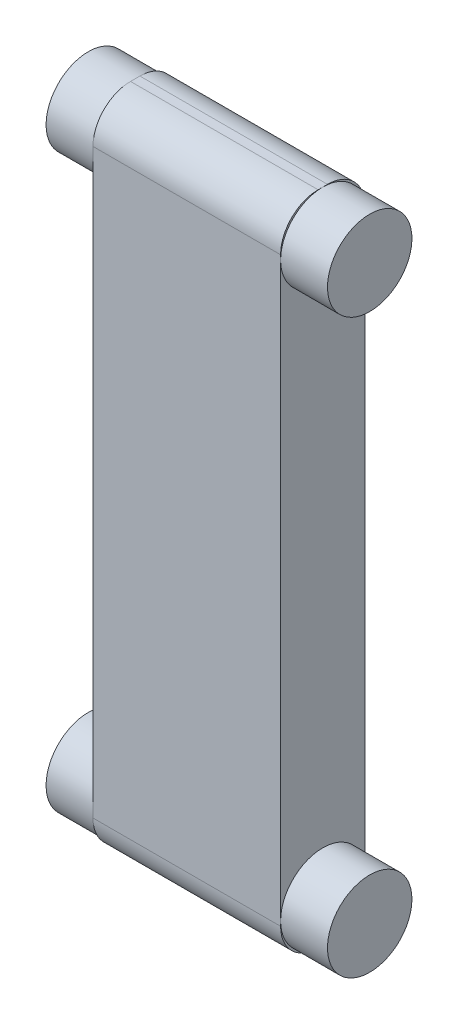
ISO-10303-21;
HEADER;
FILE_DESCRIPTION(('STEP AP214'),'2;1');
FILE_NAME('part.step','',(''),(''),'','','');
FILE_SCHEMA(('AUTOMOTIVE_DESIGN { 1 0 10303 214 1 1 1 1 }'));
ENDSEC;
DATA;
#1=APPLICATION_CONTEXT('core data for automotive mechanical design processes');
#2=APPLICATION_PROTOCOL_DEFINITION('international standard','automotive_design',2000,#1);
#3=PRODUCT_CONTEXT('',#1,'mechanical');
#4=PRODUCT('Part','Part','',(#3));
#5=PRODUCT_RELATED_PRODUCT_CATEGORY('part','',(#4));
#6=PRODUCT_DEFINITION_FORMATION('','',#4);
#7=PRODUCT_DEFINITION_CONTEXT('part definition',#1,'design');
#8=PRODUCT_DEFINITION('design','',#6,#7);
#9=PRODUCT_DEFINITION_SHAPE('','',#8);
#10=(LENGTH_UNIT() NAMED_UNIT(*) SI_UNIT(.MILLI.,.METRE.));
#11=(NAMED_UNIT(*) PLANE_ANGLE_UNIT() SI_UNIT($,.RADIAN.));
#12=(NAMED_UNIT(*) SI_UNIT($,.STERADIAN.) SOLID_ANGLE_UNIT());
#13=UNCERTAINTY_MEASURE_WITH_UNIT(LENGTH_MEASURE(1.E-05),#10,'distance_accuracy_value','');
#14=(GEOMETRIC_REPRESENTATION_CONTEXT(3) GLOBAL_UNCERTAINTY_ASSIGNED_CONTEXT((#13)) GLOBAL_UNIT_ASSIGNED_CONTEXT((#10,
#11,#12)) REPRESENTATION_CONTEXT('',''));
#15=CARTESIAN_POINT('',(0.,0.,0.));
#16=DIRECTION('',(0.,0.,1.));
#17=DIRECTION('',(1.,0.,0.));
#18=AXIS2_PLACEMENT_3D('',#15,#16,#17);
#19=CARTESIAN_POINT('',(50.,305.,45.));
#20=DIRECTION('',(-1.,0.,0.));
#21=DIRECTION('',(0.,-1.,0.));
#22=AXIS2_PLACEMENT_3D('',#19,#20,#21);
#23=PLANE('',#22);
#24=CARTESIAN_POINT('',(50.,327.5,22.5));
#25=DIRECTION('',(-1.,0.,0.));
#26=DIRECTION('',(0.,-1.,0.));
#27=AXIS2_PLACEMENT_3D('',#24,#25,#26);
#28=CIRCLE('',#27,22.5);
#29=CARTESIAN_POINT('',(50.,327.5,45.));
#30=VERTEX_POINT('',#29);
#31=CARTESIAN_POINT('',(50.,327.5,0.));
#32=VERTEX_POINT('',#31);
#33=EDGE_CURVE('E301',#30,#32,#28,.F.);
#34=ORIENTED_EDGE('',*,*,#33,.F.);
#35=DIRECTION('',(0.,1.,0.));
#36=VECTOR('',#35,1.);
#37=CARTESIAN_POINT('',(50.,305.,45.));
#38=LINE('',#37,#36);
#39=CARTESIAN_POINT('',(50.,22.5000000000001,45.));
#40=VERTEX_POINT('',#39);
#41=EDGE_CURVE('E191',#40,#30,#38,.T.);
#42=ORIENTED_EDGE('',*,*,#41,.F.);
#43=CARTESIAN_POINT('',(50.,22.5000000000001,22.5));
#44=DIRECTION('',(-1.,0.,0.));
#45=DIRECTION('',(0.,-1.,0.));
#46=AXIS2_PLACEMENT_3D('',#43,#44,#45);
#47=CIRCLE('',#46,22.5);
#48=CARTESIAN_POINT('',(50.,22.5000000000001,0.));
#49=VERTEX_POINT('',#48);
#50=EDGE_CURVE('E272',#49,#40,#47,.F.);
#51=ORIENTED_EDGE('',*,*,#50,.F.);
#52=DIRECTION('',(0.,1.,0.));
#53=VECTOR('',#52,1.);
#54=CARTESIAN_POINT('',(50.,305.,0.));
#55=LINE('',#54,#53);
#56=EDGE_CURVE('E192',#49,#32,#55,.T.);
#57=ORIENTED_EDGE('',*,*,#56,.T.);
#58=EDGE_LOOP('',(#34,#42,#51,#57));
#59=FACE_BOUND('',#58,.T.);
#60=ADVANCED_FACE('F65',(#59),#23,.F.);
#61=CARTESIAN_POINT('',(-74.9999999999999,350.,45.));
#62=DIRECTION('',(0.,-1.,0.));
#63=DIRECTION('',(0.,0.,-1.));
#64=AXIS2_PLACEMENT_3D('',#61,#62,#63);
#65=PLANE('',#64);
#66=DIRECTION('',(0.,0.,-1.));
#67=VECTOR('',#66,1.);
#68=CARTESIAN_POINT('',(50.,350.,45.));
#69=LINE('',#68,#67);
#70=CARTESIAN_POINT('',(50.,350.,22.5));
#71=VERTEX_POINT('',#70);
#72=CARTESIAN_POINT('',(50.,350.,20.));
#73=VERTEX_POINT('',#72);
#74=EDGE_CURVE('E305',#71,#73,#69,.T.);
#75=ORIENTED_EDGE('',*,*,#74,.T.);
#76=DIRECTION('',(-1.,0.,0.));
#77=VECTOR('',#76,1.);
#78=CARTESIAN_POINT('',(-74.9999999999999,350.,20.));
#79=LINE('',#78,#77);
#80=CARTESIAN_POINT('',(-50.0000000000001,350.,20.));
#81=VERTEX_POINT('',#80);
#82=EDGE_CURVE('E333',#73,#81,#79,.T.);
#83=ORIENTED_EDGE('',*,*,#82,.T.);
#84=DIRECTION('',(0.,0.,1.));
#85=VECTOR('',#84,1.);
#86=CARTESIAN_POINT('',(-50.0000000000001,350.,45.));
#87=LINE('',#86,#85);
#88=CARTESIAN_POINT('',(-50.0000000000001,350.,22.5));
#89=VERTEX_POINT('',#88);
#90=EDGE_CURVE('E288',#81,#89,#87,.T.);
#91=ORIENTED_EDGE('',*,*,#90,.T.);
#92=CARTESIAN_POINT('',(-50.0000000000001,350.,25.));
#93=VERTEX_POINT('',#92);
#94=EDGE_CURVE('E291',#89,#93,#87,.T.);
#95=ORIENTED_EDGE('',*,*,#94,.T.);
#96=DIRECTION('',(-1.,0.,0.));
#97=VECTOR('',#96,1.);
#98=CARTESIAN_POINT('',(50.,350.,25.));
#99=LINE('',#98,#97);
#100=CARTESIAN_POINT('',(50.,350.,25.));
#101=VERTEX_POINT('',#100);
#102=EDGE_CURVE('E179',#93,#101,#99,.F.);
#103=ORIENTED_EDGE('',*,*,#102,.T.);
#104=EDGE_CURVE('E310',#101,#71,#69,.T.);
#105=ORIENTED_EDGE('',*,*,#104,.T.);
#106=EDGE_LOOP('',(#75,#83,#91,#95,#103,#105));
#107=FACE_BOUND('',#106,.T.);
#108=ADVANCED_FACE('F234',(#107),#65,.F.);
#109=CARTESIAN_POINT('',(-50.,45.,45.));
#110=DIRECTION('',(1.,0.,0.));
#111=DIRECTION('',(0.,1.,0.));
#112=AXIS2_PLACEMENT_3D('',#109,#110,#111);
#113=PLANE('',#112);
#114=DIRECTION('',(0.,-1.,0.));
#115=VECTOR('',#114,1.);
#116=CARTESIAN_POINT('',(-50.,45.,0.));
#117=LINE('',#116,#115);
#118=CARTESIAN_POINT('',(-50.0000000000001,327.5,0.));
#119=VERTEX_POINT('',#118);
#120=CARTESIAN_POINT('',(-50.,22.5,0.));
#121=VERTEX_POINT('',#120);
#122=EDGE_CURVE('E171',#119,#121,#117,.T.);
#123=ORIENTED_EDGE('',*,*,#122,.T.);
#124=CARTESIAN_POINT('',(-50.,22.5,22.5));
#125=DIRECTION('',(1.,0.,0.));
#126=DIRECTION('',(0.,1.,0.));
#127=AXIS2_PLACEMENT_3D('',#124,#125,#126);
#128=CIRCLE('',#127,22.5);
#129=CARTESIAN_POINT('',(-50.,22.5,45.));
#130=VERTEX_POINT('',#129);
#131=EDGE_CURVE('E186',#130,#121,#128,.F.);
#132=ORIENTED_EDGE('',*,*,#131,.F.);
#133=DIRECTION('',(0.,-1.,0.));
#134=VECTOR('',#133,1.);
#135=CARTESIAN_POINT('',(-50.,45.,45.));
#136=LINE('',#135,#134);
#137=CARTESIAN_POINT('',(-50.0000000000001,327.5,45.));
#138=VERTEX_POINT('',#137);
#139=EDGE_CURVE('E317',#138,#130,#136,.T.);
#140=ORIENTED_EDGE('',*,*,#139,.F.);
#141=CARTESIAN_POINT('',(-50.0000000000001,327.5,22.5));
#142=DIRECTION('',(1.,0.,0.));
#143=DIRECTION('',(0.,1.,0.));
#144=AXIS2_PLACEMENT_3D('',#141,#142,#143);
#145=CIRCLE('',#144,22.5);
#146=EDGE_CURVE('E189',#119,#138,#145,.F.);
#147=ORIENTED_EDGE('',*,*,#146,.F.);
#148=EDGE_LOOP('',(#123,#132,#140,#147));
#149=FACE_BOUND('',#148,.T.);
#150=ADVANCED_FACE('F184',(#149),#113,.F.);
#151=CARTESIAN_POINT('',(-75.,0.,45.));
#152=DIRECTION('',(0.,1.,0.));
#153=DIRECTION('',(-1.,0.,0.));
#154=AXIS2_PLACEMENT_3D('',#151,#152,#153);
#155=PLANE('',#154);
#156=DIRECTION('',(0.,0.,-1.));
#157=VECTOR('',#156,1.);
#158=CARTESIAN_POINT('',(-50.,0.,45.));
#159=LINE('',#158,#157);
#160=CARTESIAN_POINT('',(-50.,0.,22.5));
#161=VERTEX_POINT('',#160);
#162=CARTESIAN_POINT('',(-50.,0.,20.));
#163=VERTEX_POINT('',#162);
#164=EDGE_CURVE('E199',#161,#163,#159,.T.);
#165=ORIENTED_EDGE('',*,*,#164,.T.);
#166=DIRECTION('',(1.,0.,0.));
#167=VECTOR('',#166,1.);
#168=CARTESIAN_POINT('',(-75.,0.,20.));
#169=LINE('',#168,#167);
#170=CARTESIAN_POINT('',(50.,0.,20.));
#171=VERTEX_POINT('',#170);
#172=EDGE_CURVE('E365',#163,#171,#169,.T.);
#173=ORIENTED_EDGE('',*,*,#172,.T.);
#174=DIRECTION('',(0.,0.,1.));
#175=VECTOR('',#174,1.);
#176=CARTESIAN_POINT('',(50.,0.,45.));
#177=LINE('',#176,#175);
#178=CARTESIAN_POINT('',(50.,0.,22.5));
#179=VERTEX_POINT('',#178);
#180=EDGE_CURVE('E261',#171,#179,#177,.T.);
#181=ORIENTED_EDGE('',*,*,#180,.T.);
#182=CARTESIAN_POINT('',(50.,0.,25.));
#183=VERTEX_POINT('',#182);
#184=EDGE_CURVE('E267',#179,#183,#177,.T.);
#185=ORIENTED_EDGE('',*,*,#184,.T.);
#186=DIRECTION('',(1.,0.,0.));
#187=VECTOR('',#186,1.);
#188=CARTESIAN_POINT('',(-50.,0.,25.));
#189=LINE('',#188,#187);
#190=CARTESIAN_POINT('',(-50.,0.,25.));
#191=VERTEX_POINT('',#190);
#192=EDGE_CURVE('E362',#183,#191,#189,.F.);
#193=ORIENTED_EDGE('',*,*,#192,.T.);
#194=EDGE_CURVE('E209',#191,#161,#159,.T.);
#195=ORIENTED_EDGE('',*,*,#194,.T.);
#196=EDGE_LOOP('',(#165,#173,#181,#185,#193,#195));
#197=FACE_BOUND('',#196,.T.);
#198=ADVANCED_FACE('F422',(#197),#155,.F.);
#199=CARTESIAN_POINT('',(0.,0.,45.));
#200=DIRECTION('',(0.,0.,1.));
#201=DIRECTION('',(1.,0.,0.));
#202=AXIS2_PLACEMENT_3D('',#199,#200,#201);
#203=PLANE('',#202);
#204=DIRECTION('',(0.,-1.,0.));
#205=VECTOR('',#204,1.);
#206=CARTESIAN_POINT('',(50.,0.,45.));
#207=LINE('',#206,#205);
#208=CARTESIAN_POINT('',(50.,330.,45.));
#209=VERTEX_POINT('',#208);
#210=EDGE_CURVE('E311',#209,#30,#207,.T.);
#211=ORIENTED_EDGE('',*,*,#210,.F.);
#212=DIRECTION('',(-1.,0.,0.));
#213=VECTOR('',#212,1.);
#214=CARTESIAN_POINT('',(-50.0000000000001,330.,45.));
#215=LINE('',#214,#213);
#216=CARTESIAN_POINT('',(-50.0000000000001,330.,45.));
#217=VERTEX_POINT('',#216);
#218=EDGE_CURVE('E352',#209,#217,#215,.T.);
#219=ORIENTED_EDGE('',*,*,#218,.T.);
#220=DIRECTION('',(0.,1.,0.));
#221=VECTOR('',#220,1.);
#222=CARTESIAN_POINT('',(-50.,0.,45.));
#223=LINE('',#222,#221);
#224=EDGE_CURVE('E292',#138,#217,#223,.T.);
#225=ORIENTED_EDGE('',*,*,#224,.F.);
#226=ORIENTED_EDGE('',*,*,#139,.T.);
#227=DIRECTION('',(0.,1.,0.));
#228=VECTOR('',#227,1.);
#229=CARTESIAN_POINT('',(-50.,0.,45.));
#230=LINE('',#229,#228);
#231=CARTESIAN_POINT('',(-50.,20.,45.));
#232=VERTEX_POINT('',#231);
#233=EDGE_CURVE('E445',#232,#130,#230,.T.);
#234=ORIENTED_EDGE('',*,*,#233,.F.);
#235=DIRECTION('',(1.,0.,0.));
#236=VECTOR('',#235,1.);
#237=CARTESIAN_POINT('',(50.,20.,45.));
#238=LINE('',#237,#236);
#239=CARTESIAN_POINT('',(50.,20.,45.));
#240=VERTEX_POINT('',#239);
#241=EDGE_CURVE('E348',#232,#240,#238,.T.);
#242=ORIENTED_EDGE('',*,*,#241,.T.);
#243=DIRECTION('',(0.,-1.,0.));
#244=VECTOR('',#243,1.);
#245=CARTESIAN_POINT('',(50.,0.,45.));
#246=LINE('',#245,#244);
#247=EDGE_CURVE('E271',#40,#240,#246,.T.);
#248=ORIENTED_EDGE('',*,*,#247,.F.);
#249=ORIENTED_EDGE('',*,*,#41,.T.);
#250=EDGE_LOOP('',(#211,#219,#225,#226,#234,#242,#248,#249));
#251=FACE_BOUND('',#250,.T.);
#252=ADVANCED_FACE('F411',(#251),#203,.T.);
#253=CARTESIAN_POINT('',(0.,0.,0.));
#254=DIRECTION('',(0.,0.,1.));
#255=DIRECTION('',(1.,0.,0.));
#256=AXIS2_PLACEMENT_3D('',#253,#254,#255);
#257=PLANE('',#256);
#258=DIRECTION('',(0.,1.,0.));
#259=VECTOR('',#258,1.);
#260=CARTESIAN_POINT('',(-50.,0.,0.));
#261=LINE('',#260,#259);
#262=CARTESIAN_POINT('',(-50.0000000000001,330.,0.));
#263=VERTEX_POINT('',#262);
#264=EDGE_CURVE('E326',#119,#263,#261,.T.);
#265=ORIENTED_EDGE('',*,*,#264,.T.);
#266=DIRECTION('',(-1.,0.,0.));
#267=VECTOR('',#266,1.);
#268=CARTESIAN_POINT('',(0.,330.,0.));
#269=LINE('',#268,#267);
#270=CARTESIAN_POINT('',(50.,330.,0.));
#271=VERTEX_POINT('',#270);
#272=EDGE_CURVE('E342',#263,#271,#269,.F.);
#273=ORIENTED_EDGE('',*,*,#272,.T.);
#274=DIRECTION('',(0.,-1.,0.));
#275=VECTOR('',#274,1.);
#276=CARTESIAN_POINT('',(50.,0.,0.));
#277=LINE('',#276,#275);
#278=EDGE_CURVE('E320',#271,#32,#277,.T.);
#279=ORIENTED_EDGE('',*,*,#278,.T.);
#280=ORIENTED_EDGE('',*,*,#56,.F.);
#281=DIRECTION('',(0.,-1.,0.));
#282=VECTOR('',#281,1.);
#283=CARTESIAN_POINT('',(50.,0.,0.));
#284=LINE('',#283,#282);
#285=CARTESIAN_POINT('',(50.,20.,0.));
#286=VERTEX_POINT('',#285);
#287=EDGE_CURVE('E180',#49,#286,#284,.T.);
#288=ORIENTED_EDGE('',*,*,#287,.T.);
#289=DIRECTION('',(1.,0.,0.));
#290=VECTOR('',#289,1.);
#291=CARTESIAN_POINT('',(0.,20.,0.));
#292=LINE('',#291,#290);
#293=CARTESIAN_POINT('',(-50.,20.,0.));
#294=VERTEX_POINT('',#293);
#295=EDGE_CURVE('E174',#286,#294,#292,.F.);
#296=ORIENTED_EDGE('',*,*,#295,.T.);
#297=DIRECTION('',(0.,1.,0.));
#298=VECTOR('',#297,1.);
#299=CARTESIAN_POINT('',(-50.,0.,0.));
#300=LINE('',#299,#298);
#301=EDGE_CURVE('E167',#294,#121,#300,.T.);
#302=ORIENTED_EDGE('',*,*,#301,.T.);
#303=ORIENTED_EDGE('',*,*,#122,.F.);
#304=EDGE_LOOP('',(#265,#273,#279,#280,#288,#296,#302,#303));
#305=FACE_BOUND('',#304,.T.);
#306=ADVANCED_FACE('F170',(#305),#257,.F.);
#307=CARTESIAN_POINT('',(-41.9238815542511,327.5,22.5));
#308=DIRECTION('',(1.,0.,0.));
#309=DIRECTION('',(0.,1.,0.));
#310=AXIS2_PLACEMENT_3D('',#307,#308,#309);
#311=CYLINDRICAL_SURFACE('',#310,22.5);
#312=CARTESIAN_POINT('',(75.0000000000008,327.5,22.5));
#313=DIRECTION('',(1.,0.,0.));
#314=DIRECTION('',(0.,1.,0.));
#315=AXIS2_PLACEMENT_3D('',#312,#313,#314);
#316=CIRCLE('',#315,22.5);
#317=CARTESIAN_POINT('',(75.0000000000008,350.,22.5));
#318=VERTEX_POINT('',#317);
#319=EDGE_CURVE('E296',#318,#318,#316,.T.);
#320=ORIENTED_EDGE('',*,*,#319,.F.);
#321=EDGE_LOOP('',(#320));
#322=FACE_BOUND('',#321,.T.);
#323=EDGE_CURVE('E300',#71,#30,#28,.F.);
#324=ORIENTED_EDGE('',*,*,#323,.T.);
#325=ORIENTED_EDGE('',*,*,#33,.T.);
#326=EDGE_CURVE('E306',#32,#71,#28,.F.);
#327=ORIENTED_EDGE('',*,*,#326,.T.);
#328=EDGE_LOOP('',(#324,#325,#327));
#329=FACE_BOUND('',#328,.T.);
#330=ADVANCED_FACE('F529',(#322,#329),#311,.T.);
#331=ORIENTED_EDGE('',*,*,#278,.F.);
#332=CARTESIAN_POINT('',(50.,330.,20.));
#333=DIRECTION('',(-1.,0.,0.));
#334=DIRECTION('',(0.,-1.,0.));
#335=AXIS2_PLACEMENT_3D('',#332,#333,#334);
#336=CIRCLE('',#335,20.);
#337=EDGE_CURVE('E345',#271,#73,#336,.F.);
#338=ORIENTED_EDGE('',*,*,#337,.T.);
#339=ORIENTED_EDGE('',*,*,#74,.F.);
#340=ORIENTED_EDGE('',*,*,#326,.F.);
#341=EDGE_LOOP('',(#331,#338,#339,#340));
#342=FACE_BOUND('',#341,.T.);
#343=ADVANCED_FACE('F248',(#342),#23,.F.);
#344=ORIENTED_EDGE('',*,*,#104,.F.);
#345=CARTESIAN_POINT('',(50.,330.,25.));
#346=DIRECTION('',(-1.,0.,0.));
#347=DIRECTION('',(0.,-1.,0.));
#348=AXIS2_PLACEMENT_3D('',#345,#346,#347);
#349=CIRCLE('',#348,20.);
#350=EDGE_CURVE('E359',#101,#209,#349,.F.);
#351=ORIENTED_EDGE('',*,*,#350,.T.);
#352=ORIENTED_EDGE('',*,*,#210,.T.);
#353=ORIENTED_EDGE('',*,*,#323,.F.);
#354=EDGE_LOOP('',(#344,#351,#352,#353));
#355=FACE_BOUND('',#354,.T.);
#356=ADVANCED_FACE('F237',(#355),#23,.F.);
#357=CARTESIAN_POINT('',(74.9999999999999,350.,45.));
#358=DIRECTION('',(-1.,0.,0.));
#359=DIRECTION('',(0.,-1.,0.));
#360=AXIS2_PLACEMENT_3D('',#357,#358,#359);
#361=PLANE('',#360);
#362=ORIENTED_EDGE('',*,*,#319,.T.);
#363=EDGE_LOOP('',(#362));
#364=FACE_BOUND('',#363,.T.);
#365=ADVANCED_FACE('F247',(#364),#361,.F.);
#366=CARTESIAN_POINT('',(70.208152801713,327.5,22.5));
#367=DIRECTION('',(-1.,0.,0.));
#368=DIRECTION('',(0.,0.,1.));
#369=AXIS2_PLACEMENT_3D('',#366,#367,#368);
#370=CYLINDRICAL_SURFACE('',#369,22.5);
#371=CARTESIAN_POINT('',(-75.000000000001,327.5,22.5));
#372=DIRECTION('',(-1.,0.,0.));
#373=DIRECTION('',(0.,0.,1.));
#374=AXIS2_PLACEMENT_3D('',#371,#372,#373);
#375=CIRCLE('',#374,22.5);
#376=CARTESIAN_POINT('',(-75.000000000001,327.5,45.));
#377=VERTEX_POINT('',#376);
#378=EDGE_CURVE('E279',#377,#377,#375,.T.);
#379=ORIENTED_EDGE('',*,*,#378,.F.);
#380=EDGE_LOOP('',(#379));
#381=FACE_BOUND('',#380,.T.);
#382=EDGE_CURVE('E283',#138,#89,#145,.F.);
#383=ORIENTED_EDGE('',*,*,#382,.T.);
#384=EDGE_CURVE('E284',#89,#119,#145,.F.);
#385=ORIENTED_EDGE('',*,*,#384,.T.);
#386=ORIENTED_EDGE('',*,*,#146,.T.);
#387=EDGE_LOOP('',(#383,#385,#386));
#388=FACE_BOUND('',#387,.T.);
#389=ADVANCED_FACE('F386',(#381,#388),#370,.T.);
#390=ORIENTED_EDGE('',*,*,#90,.F.);
#391=CARTESIAN_POINT('',(-50.0000000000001,330.,20.));
#392=DIRECTION('',(1.,0.,0.));
#393=DIRECTION('',(0.,1.,0.));
#394=AXIS2_PLACEMENT_3D('',#391,#392,#393);
#395=CIRCLE('',#394,20.);
#396=EDGE_CURVE('E337',#81,#263,#395,.F.);
#397=ORIENTED_EDGE('',*,*,#396,.T.);
#398=ORIENTED_EDGE('',*,*,#264,.F.);
#399=ORIENTED_EDGE('',*,*,#384,.F.);
#400=EDGE_LOOP('',(#390,#397,#398,#399));
#401=FACE_BOUND('',#400,.T.);
#402=ADVANCED_FACE('F392',(#401),#113,.F.);
#403=ORIENTED_EDGE('',*,*,#224,.T.);
#404=CARTESIAN_POINT('',(-50.0000000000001,330.,25.));
#405=DIRECTION('',(1.,0.,0.));
#406=DIRECTION('',(0.,1.,0.));
#407=AXIS2_PLACEMENT_3D('',#404,#405,#406);
#408=CIRCLE('',#407,20.);
#409=EDGE_CURVE('E356',#217,#93,#408,.F.);
#410=ORIENTED_EDGE('',*,*,#409,.T.);
#411=ORIENTED_EDGE('',*,*,#94,.F.);
#412=ORIENTED_EDGE('',*,*,#382,.F.);
#413=EDGE_LOOP('',(#403,#410,#411,#412));
#414=FACE_BOUND('',#413,.T.);
#415=ADVANCED_FACE('F412',(#414),#113,.F.);
#416=CARTESIAN_POINT('',(-75.0000000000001,305.,45.));
#417=DIRECTION('',(1.,0.,0.));
#418=DIRECTION('',(0.,1.,0.));
#419=AXIS2_PLACEMENT_3D('',#416,#417,#418);
#420=PLANE('',#419);
#421=ORIENTED_EDGE('',*,*,#378,.T.);
#422=EDGE_LOOP('',(#421));
#423=FACE_BOUND('',#422,.T.);
#424=ADVANCED_FACE('F257',(#423),#420,.F.);
#425=CARTESIAN_POINT('',(-70.2081528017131,22.5000000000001,22.5));
#426=DIRECTION('',(1.,0.,0.));
#427=DIRECTION('',(0.,0.,-1.));
#428=AXIS2_PLACEMENT_3D('',#425,#426,#427);
#429=CYLINDRICAL_SURFACE('',#428,22.5);
#430=CARTESIAN_POINT('',(75.,22.5000000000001,22.5));
#431=DIRECTION('',(1.,0.,0.));
#432=DIRECTION('',(0.,0.,-1.));
#433=AXIS2_PLACEMENT_3D('',#430,#431,#432);
#434=CIRCLE('',#433,22.5);
#435=CARTESIAN_POINT('',(75.,22.5000000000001,0.));
#436=VERTEX_POINT('',#435);
#437=EDGE_CURVE('E455',#436,#436,#434,.T.);
#438=ORIENTED_EDGE('',*,*,#437,.F.);
#439=EDGE_LOOP('',(#438));
#440=FACE_BOUND('',#439,.T.);
#441=EDGE_CURVE('E264',#179,#49,#47,.F.);
#442=ORIENTED_EDGE('',*,*,#441,.T.);
#443=ORIENTED_EDGE('',*,*,#50,.T.);
#444=EDGE_CURVE('E274',#40,#179,#47,.F.);
#445=ORIENTED_EDGE('',*,*,#444,.T.);
#446=EDGE_LOOP('',(#442,#443,#445));
#447=FACE_BOUND('',#446,.T.);
#448=ADVANCED_FACE('F251',(#440,#447),#429,.T.);
#449=ORIENTED_EDGE('',*,*,#180,.F.);
#450=CARTESIAN_POINT('',(50.,20.,20.));
#451=DIRECTION('',(-1.,0.,0.));
#452=DIRECTION('',(0.,-1.,0.));
#453=AXIS2_PLACEMENT_3D('',#450,#451,#452);
#454=CIRCLE('',#453,20.);
#455=EDGE_CURVE('E88',#171,#286,#454,.F.);
#456=ORIENTED_EDGE('',*,*,#455,.T.);
#457=ORIENTED_EDGE('',*,*,#287,.F.);
#458=ORIENTED_EDGE('',*,*,#441,.F.);
#459=EDGE_LOOP('',(#449,#456,#457,#458));
#460=FACE_BOUND('',#459,.T.);
#461=ADVANCED_FACE('F238',(#460),#23,.F.);
#462=ORIENTED_EDGE('',*,*,#247,.T.);
#463=CARTESIAN_POINT('',(50.,20.,25.));
#464=DIRECTION('',(-1.,0.,0.));
#465=DIRECTION('',(0.,-1.,0.));
#466=AXIS2_PLACEMENT_3D('',#463,#464,#465);
#467=CIRCLE('',#466,20.);
#468=EDGE_CURVE('E74',#240,#183,#467,.F.);
#469=ORIENTED_EDGE('',*,*,#468,.T.);
#470=ORIENTED_EDGE('',*,*,#184,.F.);
#471=ORIENTED_EDGE('',*,*,#444,.F.);
#472=EDGE_LOOP('',(#462,#469,#470,#471));
#473=FACE_BOUND('',#472,.T.);
#474=ADVANCED_FACE('F229',(#473),#23,.F.);
#475=CARTESIAN_POINT('',(75.,45.,45.));
#476=DIRECTION('',(-1.,0.,0.));
#477=DIRECTION('',(0.,-1.,0.));
#478=AXIS2_PLACEMENT_3D('',#475,#476,#477);
#479=PLANE('',#478);
#480=ORIENTED_EDGE('',*,*,#437,.T.);
#481=EDGE_LOOP('',(#480));
#482=FACE_BOUND('',#481,.T.);
#483=ADVANCED_FACE('F221',(#482),#479,.F.);
#484=CARTESIAN_POINT('',(70.2081528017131,22.5,22.5));
#485=DIRECTION('',(-1.,0.,0.));
#486=DIRECTION('',(0.,0.,1.));
#487=AXIS2_PLACEMENT_3D('',#484,#485,#486);
#488=CYLINDRICAL_SURFACE('',#487,22.5);
#489=CARTESIAN_POINT('',(-75.,22.5,22.5));
#490=DIRECTION('',(-1.,0.,0.));
#491=DIRECTION('',(0.,0.,1.));
#492=AXIS2_PLACEMENT_3D('',#489,#490,#491);
#493=CIRCLE('',#492,22.5);
#494=CARTESIAN_POINT('',(-75.,22.5,45.));
#495=VERTEX_POINT('',#494);
#496=EDGE_CURVE('E213',#495,#495,#493,.T.);
#497=ORIENTED_EDGE('',*,*,#496,.F.);
#498=EDGE_LOOP('',(#497));
#499=FACE_BOUND('',#498,.T.);
#500=EDGE_CURVE('E204',#161,#130,#128,.F.);
#501=ORIENTED_EDGE('',*,*,#500,.T.);
#502=ORIENTED_EDGE('',*,*,#131,.T.);
#503=EDGE_CURVE('E196',#121,#161,#128,.F.);
#504=ORIENTED_EDGE('',*,*,#503,.T.);
#505=EDGE_LOOP('',(#501,#502,#504));
#506=FACE_BOUND('',#505,.T.);
#507=ADVANCED_FACE('F206',(#499,#506),#488,.T.);
#508=ORIENTED_EDGE('',*,*,#301,.F.);
#509=CARTESIAN_POINT('',(-50.,20.,20.));
#510=DIRECTION('',(1.,0.,0.));
#511=DIRECTION('',(0.,1.,0.));
#512=AXIS2_PLACEMENT_3D('',#509,#510,#511);
#513=CIRCLE('',#512,20.);
#514=EDGE_CURVE('E370',#294,#163,#513,.F.);
#515=ORIENTED_EDGE('',*,*,#514,.T.);
#516=ORIENTED_EDGE('',*,*,#164,.F.);
#517=ORIENTED_EDGE('',*,*,#503,.F.);
#518=EDGE_LOOP('',(#508,#515,#516,#517));
#519=FACE_BOUND('',#518,.T.);
#520=ADVANCED_FACE('F197',(#519),#113,.F.);
#521=ORIENTED_EDGE('',*,*,#194,.F.);
#522=CARTESIAN_POINT('',(-50.,20.,25.));
#523=DIRECTION('',(1.,0.,0.));
#524=DIRECTION('',(0.,1.,0.));
#525=AXIS2_PLACEMENT_3D('',#522,#523,#524);
#526=CIRCLE('',#525,20.);
#527=EDGE_CURVE('E12',#191,#232,#526,.F.);
#528=ORIENTED_EDGE('',*,*,#527,.T.);
#529=ORIENTED_EDGE('',*,*,#233,.T.);
#530=ORIENTED_EDGE('',*,*,#500,.F.);
#531=EDGE_LOOP('',(#521,#528,#529,#530));
#532=FACE_BOUND('',#531,.T.);
#533=ADVANCED_FACE('F227',(#532),#113,.F.);
#534=CARTESIAN_POINT('',(-75.,0.,45.));
#535=DIRECTION('',(1.,0.,0.));
#536=DIRECTION('',(0.,0.,-1.));
#537=AXIS2_PLACEMENT_3D('',#534,#535,#536);
#538=PLANE('',#537);
#539=ORIENTED_EDGE('',*,*,#496,.T.);
#540=EDGE_LOOP('',(#539));
#541=FACE_BOUND('',#540,.T.);
#542=ADVANCED_FACE('F218',(#541),#538,.F.);
#543=CARTESIAN_POINT('',(-74.9999999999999,330.,20.));
#544=DIRECTION('',(-1.,0.,0.));
#545=DIRECTION('',(0.,0.,1.));
#546=AXIS2_PLACEMENT_3D('',#543,#544,#545);
#547=CYLINDRICAL_SURFACE('',#546,20.);
#548=ORIENTED_EDGE('',*,*,#337,.F.);
#549=ORIENTED_EDGE('',*,*,#272,.F.);
#550=ORIENTED_EDGE('',*,*,#396,.F.);
#551=ORIENTED_EDGE('',*,*,#82,.F.);
#552=EDGE_LOOP('',(#548,#549,#550,#551));
#553=FACE_BOUND('',#552,.T.);
#554=ADVANCED_FACE('F397',(#553),#547,.T.);
#555=CARTESIAN_POINT('',(0.,330.,25.));
#556=DIRECTION('',(1.,0.,0.));
#557=DIRECTION('',(0.,0.,-1.));
#558=AXIS2_PLACEMENT_3D('',#555,#556,#557);
#559=CYLINDRICAL_SURFACE('',#558,20.);
#560=ORIENTED_EDGE('',*,*,#350,.F.);
#561=ORIENTED_EDGE('',*,*,#102,.F.);
#562=ORIENTED_EDGE('',*,*,#409,.F.);
#563=ORIENTED_EDGE('',*,*,#218,.F.);
#564=EDGE_LOOP('',(#560,#561,#562,#563));
#565=FACE_BOUND('',#564,.T.);
#566=ADVANCED_FACE('F409',(#565),#559,.T.);
#567=CARTESIAN_POINT('',(-75.,20.,20.));
#568=DIRECTION('',(1.,0.,0.));
#569=DIRECTION('',(0.,1.,0.));
#570=AXIS2_PLACEMENT_3D('',#567,#568,#569);
#571=CYLINDRICAL_SURFACE('',#570,20.);
#572=ORIENTED_EDGE('',*,*,#514,.F.);
#573=ORIENTED_EDGE('',*,*,#295,.F.);
#574=ORIENTED_EDGE('',*,*,#455,.F.);
#575=ORIENTED_EDGE('',*,*,#172,.F.);
#576=EDGE_LOOP('',(#572,#573,#574,#575));
#577=FACE_BOUND('',#576,.T.);
#578=ADVANCED_FACE('F463',(#577),#571,.T.);
#579=CARTESIAN_POINT('',(0.,20.,25.));
#580=DIRECTION('',(-1.,0.,0.));
#581=DIRECTION('',(0.,-1.,0.));
#582=AXIS2_PLACEMENT_3D('',#579,#580,#581);
#583=CYLINDRICAL_SURFACE('',#582,20.);
#584=ORIENTED_EDGE('',*,*,#527,.F.);
#585=ORIENTED_EDGE('',*,*,#192,.F.);
#586=ORIENTED_EDGE('',*,*,#468,.F.);
#587=ORIENTED_EDGE('',*,*,#241,.F.);
#588=EDGE_LOOP('',(#584,#585,#586,#587));
#589=FACE_BOUND('',#588,.T.);
#590=ADVANCED_FACE('F67',(#589),#583,.T.);
#591=CLOSED_SHELL('',(#60,#108,#150,#198,#252,#306,#330,#343,#356,#365,#389,#402,#415,#424,#448,
#461,#474,#483,#507,#520,#533,#542,#554,#566,#578,#590));
#592=MANIFOLD_SOLID_BREP('B2',#591);
#593=ADVANCED_BREP_SHAPE_REPRESENTATION('',(#18,#592),#14);
#594=SHAPE_DEFINITION_REPRESENTATION(#9,#593);
ENDSEC;
END-ISO-10303-21;
